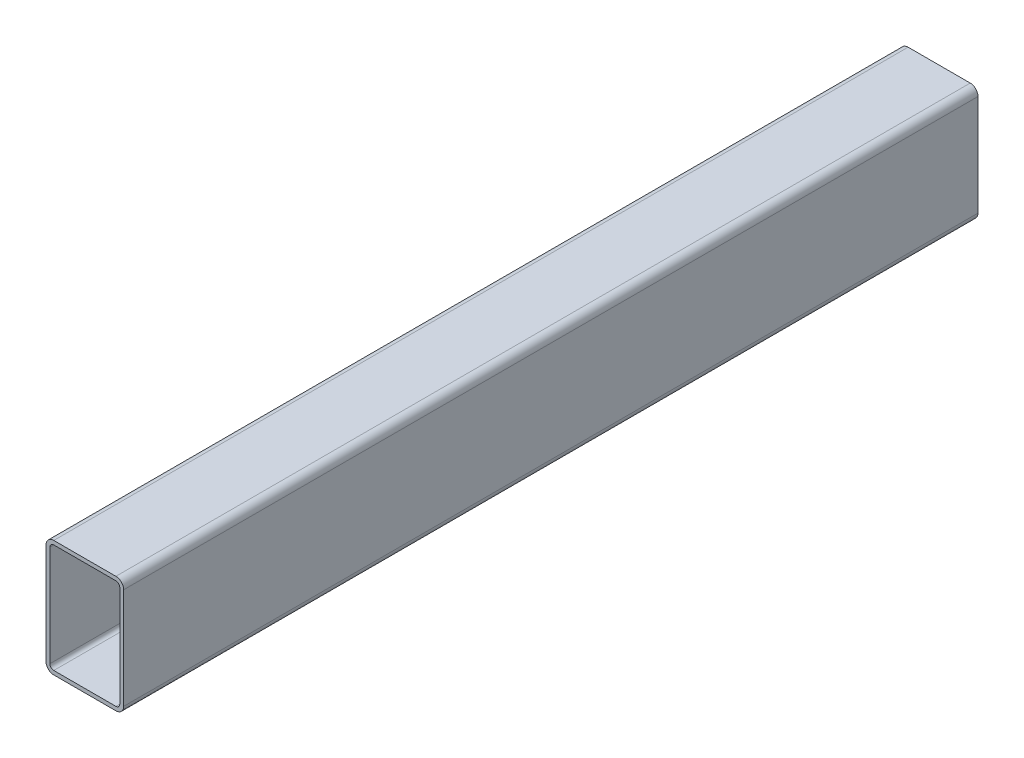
from build123d import *

# Parameters (mm, degrees)
BASE_EXTRU_MINCE_DEPTH = 220


with BuildPart() as part:
    # Esquisse1 → Base-Extru.-Mince (new, symmetric)
    with BuildSketch(Plane.XY):
        with BuildLine():
            Line((20, -26), (20, 26))
            ThreePointArc((20, 26), (18.828427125, 28.828427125), (16, 30))
            Line((16, 30), (-16, 30))
            ThreePointArc((-16, 30), (-18.828427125, 28.828427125), (-20, 26))
            Line((-20, 26), (-20, -26))
            ThreePointArc((-20, -26), (-18.828427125, -28.828427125), (-16, -30))
            Line((-16, -30), (16, -30))
            ThreePointArc((16, -30), (18.828427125, -28.828427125), (20, -26))
        make_face()
        with BuildLine():
            Line((18, -26), (18, 26))
            ThreePointArc((18, 26), (17.414213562, 27.414213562), (16, 28))
            Line((16, 28), (-16, 28))
            ThreePointArc((-16, 28), (-17.414213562, 27.414213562), (-18, 26))
            Line((-18, 26), (-18, -26))
            ThreePointArc((-18, -26), (-17.414213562, -27.414213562), (-16, -28))
            Line((-16, -28), (16, -28))
            ThreePointArc((16, -28), (17.414213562, -27.414213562), (18, -26))
        make_face(mode=Mode.SUBTRACT)
    extrude(amount=BASE_EXTRU_MINCE_DEPTH, both=True)


solid = part.part
